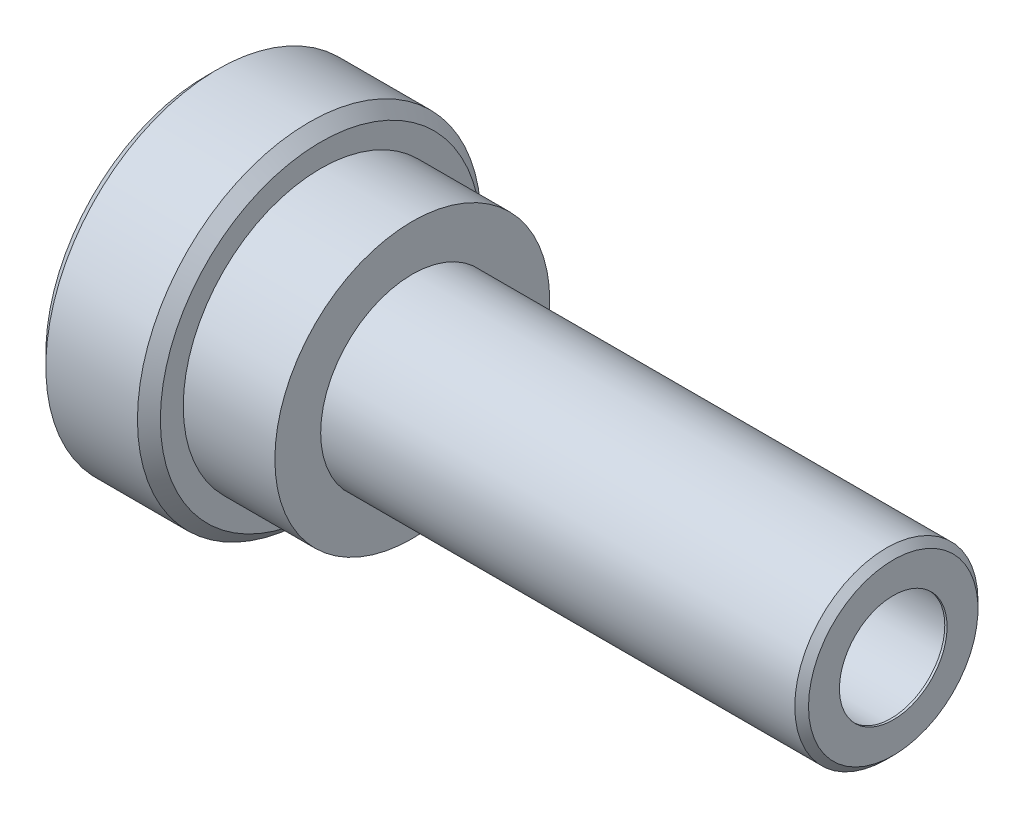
ISO-10303-21;
HEADER;
FILE_DESCRIPTION(('STEP AP214'),'2;1');
FILE_NAME('part.step','',(''),(''),'','','');
FILE_SCHEMA(('AUTOMOTIVE_DESIGN { 1 0 10303 214 1 1 1 1 }'));
ENDSEC;
DATA;
#1=APPLICATION_CONTEXT('core data for automotive mechanical design processes');
#2=APPLICATION_PROTOCOL_DEFINITION('international standard','automotive_design',2000,#1);
#3=PRODUCT_CONTEXT('',#1,'mechanical');
#4=PRODUCT('Part','Part','',(#3));
#5=PRODUCT_RELATED_PRODUCT_CATEGORY('part','',(#4));
#6=PRODUCT_DEFINITION_FORMATION('','',#4);
#7=PRODUCT_DEFINITION_CONTEXT('part definition',#1,'design');
#8=PRODUCT_DEFINITION('design','',#6,#7);
#9=PRODUCT_DEFINITION_SHAPE('','',#8);
#10=(LENGTH_UNIT() NAMED_UNIT(*) SI_UNIT(.MILLI.,.METRE.));
#11=(NAMED_UNIT(*) PLANE_ANGLE_UNIT() SI_UNIT($,.RADIAN.));
#12=(NAMED_UNIT(*) SI_UNIT($,.STERADIAN.) SOLID_ANGLE_UNIT());
#13=UNCERTAINTY_MEASURE_WITH_UNIT(LENGTH_MEASURE(1.E-05),#10,'distance_accuracy_value','');
#14=(GEOMETRIC_REPRESENTATION_CONTEXT(3) GLOBAL_UNCERTAINTY_ASSIGNED_CONTEXT((#13)) GLOBAL_UNIT_ASSIGNED_CONTEXT((#10,
#11,#12)) REPRESENTATION_CONTEXT('',''));
#15=CARTESIAN_POINT('',(0.,0.,0.));
#16=DIRECTION('',(0.,0.,1.));
#17=DIRECTION('',(1.,0.,0.));
#18=AXIS2_PLACEMENT_3D('',#15,#16,#17);
#19=CARTESIAN_POINT('',(0.,0.,0.));
#20=DIRECTION('',(1.,0.,0.));
#21=DIRECTION('',(0.,0.,-1.));
#22=AXIS2_PLACEMENT_3D('',#19,#20,#21);
#23=PLANE('',#22);
#24=CARTESIAN_POINT('',(0.,0.,0.));
#25=DIRECTION('',(1.,0.,0.));
#26=DIRECTION('',(0.,0.,-1.));
#27=AXIS2_PLACEMENT_3D('',#24,#25,#26);
#28=CIRCLE('',#27,7.00000000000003);
#29=CARTESIAN_POINT('',(0.,0.,-7.00000000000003));
#30=VERTEX_POINT('',#29);
#31=EDGE_CURVE('E17',#30,#30,#28,.T.);
#32=ORIENTED_EDGE('',*,*,#31,.F.);
#33=EDGE_LOOP('',(#32));
#34=FACE_BOUND('',#33,.T.);
#35=CARTESIAN_POINT('',(5.6843418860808E-11,0.,0.));
#36=DIRECTION('',(-1.,0.,0.));
#37=DIRECTION('',(0.,0.,1.));
#38=AXIS2_PLACEMENT_3D('',#35,#36,#37);
#39=CIRCLE('',#38,3.24999999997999);
#40=CARTESIAN_POINT('',(5.6843418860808E-11,0.,3.24999999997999));
#41=VERTEX_POINT('',#40);
#42=EDGE_CURVE('E45',#41,#41,#39,.F.);
#43=ORIENTED_EDGE('',*,*,#42,.T.);
#44=EDGE_LOOP('',(#43));
#45=FACE_BOUND('',#44,.T.);
#46=ADVANCED_FACE('F14',(#34,#45),#23,.F.);
#47=CARTESIAN_POINT('',(0.5,0.,0.));
#48=DIRECTION('',(1.,0.,0.));
#49=DIRECTION('',(0.,0.,-1.));
#50=AXIS2_PLACEMENT_3D('',#47,#48,#49);
#51=CONICAL_SURFACE('',#50,7.49999999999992,0.7853981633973);
#52=CARTESIAN_POINT('',(0.5,0.,0.));
#53=DIRECTION('',(1.,0.,0.));
#54=DIRECTION('',(0.,0.,-1.));
#55=AXIS2_PLACEMENT_3D('',#52,#53,#54);
#56=CIRCLE('',#55,7.5);
#57=CARTESIAN_POINT('',(0.5,0.,-7.5));
#58=VERTEX_POINT('',#57);
#59=EDGE_CURVE('E43',#58,#58,#56,.T.);
#60=ORIENTED_EDGE('',*,*,#59,.F.);
#61=EDGE_LOOP('',(#60));
#62=FACE_BOUND('',#61,.T.);
#63=ORIENTED_EDGE('',*,*,#31,.T.);
#64=EDGE_LOOP('',(#63));
#65=FACE_BOUND('',#64,.T.);
#66=ADVANCED_FACE('F64',(#62,#65),#51,.T.);
#67=CARTESIAN_POINT('',(5.6843418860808E-11,0.,0.));
#68=DIRECTION('',(-1.,0.,0.));
#69=DIRECTION('',(0.,0.,1.));
#70=AXIS2_PLACEMENT_3D('',#67,#68,#69);
#71=CONICAL_SURFACE('',#70,3.24999999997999,0.785398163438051);
#72=CARTESIAN_POINT('',(0.700000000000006,0.,0.));
#73=DIRECTION('',(1.,0.,0.));
#74=DIRECTION('',(0.,0.,-1.));
#75=AXIS2_PLACEMENT_3D('',#72,#73,#74);
#76=CIRCLE('',#75,2.55);
#77=CARTESIAN_POINT('',(0.700000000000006,0.,-2.55));
#78=VERTEX_POINT('',#77);
#79=EDGE_CURVE('E40',#78,#78,#76,.T.);
#80=ORIENTED_EDGE('',*,*,#79,.T.);
#81=EDGE_LOOP('',(#80));
#82=FACE_BOUND('',#81,.T.);
#83=ORIENTED_EDGE('',*,*,#42,.F.);
#84=EDGE_LOOP('',(#83));
#85=FACE_BOUND('',#84,.T.);
#86=ADVANCED_FACE('F71',(#82,#85),#71,.F.);
#87=CARTESIAN_POINT('',(-1.5,0.,0.));
#88=DIRECTION('',(1.,0.,0.));
#89=DIRECTION('',(0.,0.,-1.));
#90=AXIS2_PLACEMENT_3D('',#87,#88,#89);
#91=CYLINDRICAL_SURFACE('',#90,7.5);
#92=CARTESIAN_POINT('',(4.49999999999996,0.,0.));
#93=DIRECTION('',(-1.,0.,0.));
#94=DIRECTION('',(0.,0.,1.));
#95=AXIS2_PLACEMENT_3D('',#92,#93,#94);
#96=CIRCLE('',#95,7.49999999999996);
#97=CARTESIAN_POINT('',(4.49999999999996,0.,7.49999999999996));
#98=VERTEX_POINT('',#97);
#99=EDGE_CURVE('E37',#98,#98,#96,.F.);
#100=ORIENTED_EDGE('',*,*,#99,.F.);
#101=EDGE_LOOP('',(#100));
#102=FACE_BOUND('',#101,.T.);
#103=ORIENTED_EDGE('',*,*,#59,.T.);
#104=EDGE_LOOP('',(#103));
#105=FACE_BOUND('',#104,.T.);
#106=ADVANCED_FACE('F115',(#102,#105),#91,.T.);
#107=CARTESIAN_POINT('',(-1.5,0.,0.));
#108=DIRECTION('',(1.,0.,0.));
#109=DIRECTION('',(0.,0.,-1.));
#110=AXIS2_PLACEMENT_3D('',#107,#108,#109);
#111=CYLINDRICAL_SURFACE('',#110,2.55);
#112=CARTESIAN_POINT('',(29.7798278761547,0.,0.));
#113=DIRECTION('',(-1.,0.,0.));
#114=DIRECTION('',(0.,-1.,0.));
#115=AXIS2_PLACEMENT_3D('',#112,#113,#114);
#116=CIRCLE('',#115,2.55000000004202);
#117=CARTESIAN_POINT('',(29.7798278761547,-2.55000000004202,0.));
#118=VERTEX_POINT('',#117);
#119=EDGE_CURVE('E34',#118,#118,#116,.F.);
#120=ORIENTED_EDGE('',*,*,#119,.T.);
#121=EDGE_LOOP('',(#120));
#122=FACE_BOUND('',#121,.T.);
#123=ORIENTED_EDGE('',*,*,#79,.F.);
#124=EDGE_LOOP('',(#123));
#125=FACE_BOUND('',#124,.T.);
#126=ADVANCED_FACE('F111',(#122,#125),#111,.F.);
#127=CARTESIAN_POINT('',(4.49999999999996,0.,0.));
#128=DIRECTION('',(-1.,0.,0.));
#129=DIRECTION('',(0.,0.,1.));
#130=AXIS2_PLACEMENT_3D('',#127,#128,#129);
#131=CONICAL_SURFACE('',#130,7.49999999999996,0.785398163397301);
#132=ORIENTED_EDGE('',*,*,#99,.T.);
#133=EDGE_LOOP('',(#132));
#134=FACE_BOUND('',#133,.T.);
#135=CARTESIAN_POINT('',(5.00000000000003,0.,0.));
#136=DIRECTION('',(-1.,0.,0.));
#137=DIRECTION('',(0.,0.,1.));
#138=AXIS2_PLACEMENT_3D('',#135,#136,#137);
#139=CIRCLE('',#138,7.00000000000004);
#140=CARTESIAN_POINT('',(5.00000000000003,0.,7.00000000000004));
#141=VERTEX_POINT('',#140);
#142=EDGE_CURVE('E33',#141,#141,#139,.F.);
#143=ORIENTED_EDGE('',*,*,#142,.F.);
#144=EDGE_LOOP('',(#143));
#145=FACE_BOUND('',#144,.T.);
#146=ADVANCED_FACE('F107',(#134,#145),#131,.T.);
#147=CARTESIAN_POINT('',(29.7798278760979,0.,0.));
#148=DIRECTION('',(-1.,0.,0.));
#149=DIRECTION('',(0.,-1.,0.));
#150=AXIS2_PLACEMENT_3D('',#147,#148,#149);
#151=CONICAL_SURFACE('',#150,2.55000000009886,1.02974425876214);
#152=CARTESIAN_POINT('',(29.9,0.,0.));
#153=DIRECTION('',(1.,0.,0.));
#154=DIRECTION('',(0.,0.,-1.));
#155=AXIS2_PLACEMENT_3D('',#152,#153,#154);
#156=CIRCLE('',#155,2.35);
#157=CARTESIAN_POINT('',(29.9,0.,-2.35));
#158=VERTEX_POINT('',#157);
#159=EDGE_CURVE('E29',#158,#158,#156,.T.);
#160=ORIENTED_EDGE('',*,*,#159,.T.);
#161=EDGE_LOOP('',(#160));
#162=FACE_BOUND('',#161,.T.);
#163=ORIENTED_EDGE('',*,*,#119,.F.);
#164=EDGE_LOOP('',(#163));
#165=FACE_BOUND('',#164,.T.);
#166=ADVANCED_FACE('F103',(#162,#165),#151,.F.);
#167=CARTESIAN_POINT('',(5.,0.,0.));
#168=DIRECTION('',(1.,0.,0.));
#169=DIRECTION('',(0.,0.,-1.));
#170=AXIS2_PLACEMENT_3D('',#167,#168,#169);
#171=PLANE('',#170);
#172=ORIENTED_EDGE('',*,*,#142,.T.);
#173=EDGE_LOOP('',(#172));
#174=FACE_BOUND('',#173,.T.);
#175=CARTESIAN_POINT('',(5.,0.,0.));
#176=DIRECTION('',(1.,0.,0.));
#177=DIRECTION('',(0.,0.,-1.));
#178=AXIS2_PLACEMENT_3D('',#175,#176,#177);
#179=CIRCLE('',#178,6.);
#180=CARTESIAN_POINT('',(5.,0.,-6.));
#181=VERTEX_POINT('',#180);
#182=EDGE_CURVE('E32',#181,#181,#179,.T.);
#183=ORIENTED_EDGE('',*,*,#182,.F.);
#184=EDGE_LOOP('',(#183));
#185=FACE_BOUND('',#184,.T.);
#186=ADVANCED_FACE('F99',(#174,#185),#171,.T.);
#187=CARTESIAN_POINT('',(-1.5,0.,0.));
#188=DIRECTION('',(1.,0.,0.));
#189=DIRECTION('',(0.,0.,-1.));
#190=AXIS2_PLACEMENT_3D('',#187,#188,#189);
#191=CYLINDRICAL_SURFACE('',#190,2.35);
#192=ORIENTED_EDGE('',*,*,#159,.F.);
#193=EDGE_LOOP('',(#192));
#194=FACE_BOUND('',#193,.T.);
#195=CARTESIAN_POINT('',(30.,0.,0.));
#196=DIRECTION('',(1.,0.,0.));
#197=DIRECTION('',(0.,0.,-1.));
#198=AXIS2_PLACEMENT_3D('',#195,#196,#197);
#199=CIRCLE('',#198,2.35);
#200=CARTESIAN_POINT('',(30.,0.,-2.35));
#201=VERTEX_POINT('',#200);
#202=EDGE_CURVE('E52',#201,#201,#199,.F.);
#203=ORIENTED_EDGE('',*,*,#202,.F.);
#204=EDGE_LOOP('',(#203));
#205=FACE_BOUND('',#204,.T.);
#206=ADVANCED_FACE('F95',(#194,#205),#191,.F.);
#207=CARTESIAN_POINT('',(-1.5,0.,0.));
#208=DIRECTION('',(1.,0.,0.));
#209=DIRECTION('',(0.,0.,-1.));
#210=AXIS2_PLACEMENT_3D('',#207,#208,#209);
#211=CYLINDRICAL_SURFACE('',#210,6.);
#212=ORIENTED_EDGE('',*,*,#182,.T.);
#213=EDGE_LOOP('',(#212));
#214=FACE_BOUND('',#213,.T.);
#215=CARTESIAN_POINT('',(8.99999999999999,0.,0.));
#216=DIRECTION('',(1.,0.,0.));
#217=DIRECTION('',(0.,0.,-1.));
#218=AXIS2_PLACEMENT_3D('',#215,#216,#217);
#219=CIRCLE('',#218,6.);
#220=CARTESIAN_POINT('',(8.99999999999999,0.,-6.));
#221=VERTEX_POINT('',#220);
#222=EDGE_CURVE('E49',#221,#221,#219,.T.);
#223=ORIENTED_EDGE('',*,*,#222,.F.);
#224=EDGE_LOOP('',(#223));
#225=FACE_BOUND('',#224,.T.);
#226=ADVANCED_FACE('F91',(#214,#225),#211,.T.);
#227=CARTESIAN_POINT('',(30.,0.,0.));
#228=DIRECTION('',(1.,0.,0.));
#229=DIRECTION('',(0.,0.,-1.));
#230=AXIS2_PLACEMENT_3D('',#227,#228,#229);
#231=PLANE('',#230);
#232=CARTESIAN_POINT('',(29.9999999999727,0.,0.));
#233=DIRECTION('',(-1.,0.,0.));
#234=DIRECTION('',(0.,0.,1.));
#235=AXIS2_PLACEMENT_3D('',#232,#233,#234);
#236=CIRCLE('',#235,3.69999999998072);
#237=CARTESIAN_POINT('',(29.9999999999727,0.,3.69999999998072));
#238=VERTEX_POINT('',#237);
#239=EDGE_CURVE('E26',#238,#238,#236,.T.);
#240=ORIENTED_EDGE('',*,*,#239,.F.);
#241=EDGE_LOOP('',(#240));
#242=FACE_BOUND('',#241,.T.);
#243=ORIENTED_EDGE('',*,*,#202,.T.);
#244=EDGE_LOOP('',(#243));
#245=FACE_BOUND('',#244,.T.);
#246=ADVANCED_FACE('F87',(#242,#245),#231,.T.);
#247=CARTESIAN_POINT('',(8.99999999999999,0.,0.));
#248=DIRECTION('',(1.,0.,0.));
#249=DIRECTION('',(0.,0.,-1.));
#250=AXIS2_PLACEMENT_3D('',#247,#248,#249);
#251=PLANE('',#250);
#252=ORIENTED_EDGE('',*,*,#222,.T.);
#253=EDGE_LOOP('',(#252));
#254=FACE_BOUND('',#253,.T.);
#255=CARTESIAN_POINT('',(8.99999999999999,0.,0.));
#256=DIRECTION('',(1.,0.,0.));
#257=DIRECTION('',(0.,0.,-1.));
#258=AXIS2_PLACEMENT_3D('',#255,#256,#257);
#259=CIRCLE('',#258,4.);
#260=CARTESIAN_POINT('',(8.99999999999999,0.,-4.));
#261=VERTEX_POINT('',#260);
#262=EDGE_CURVE('E21',#261,#261,#259,.T.);
#263=ORIENTED_EDGE('',*,*,#262,.F.);
#264=EDGE_LOOP('',(#263));
#265=FACE_BOUND('',#264,.T.);
#266=ADVANCED_FACE('F80',(#254,#265),#251,.T.);
#267=CARTESIAN_POINT('',(29.6999999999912,0.,0.));
#268=DIRECTION('',(-1.,0.,0.));
#269=DIRECTION('',(0.,0.,1.));
#270=AXIS2_PLACEMENT_3D('',#267,#268,#269);
#271=CONICAL_SURFACE('',#270,3.99999999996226,0.785398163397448);
#272=CARTESIAN_POINT('',(29.7,0.,0.));
#273=DIRECTION('',(1.,0.,0.));
#274=DIRECTION('',(0.,0.,-1.));
#275=AXIS2_PLACEMENT_3D('',#272,#273,#274);
#276=CIRCLE('',#275,4.);
#277=CARTESIAN_POINT('',(29.7,0.,-4.));
#278=VERTEX_POINT('',#277);
#279=EDGE_CURVE('E10',#278,#278,#276,.F.);
#280=ORIENTED_EDGE('',*,*,#279,.F.);
#281=EDGE_LOOP('',(#280));
#282=FACE_BOUND('',#281,.T.);
#283=ORIENTED_EDGE('',*,*,#239,.T.);
#284=EDGE_LOOP('',(#283));
#285=FACE_BOUND('',#284,.T.);
#286=ADVANCED_FACE('F75',(#282,#285),#271,.T.);
#287=CARTESIAN_POINT('',(-1.5,0.,0.));
#288=DIRECTION('',(1.,0.,0.));
#289=DIRECTION('',(0.,0.,-1.));
#290=AXIS2_PLACEMENT_3D('',#287,#288,#289);
#291=CYLINDRICAL_SURFACE('',#290,4.);
#292=ORIENTED_EDGE('',*,*,#279,.T.);
#293=EDGE_LOOP('',(#292));
#294=FACE_BOUND('',#293,.T.);
#295=ORIENTED_EDGE('',*,*,#262,.T.);
#296=EDGE_LOOP('',(#295));
#297=FACE_BOUND('',#296,.T.);
#298=ADVANCED_FACE('F73',(#294,#297),#291,.T.);
#299=CLOSED_SHELL('',(#46,#66,#86,#106,#126,#146,#166,#186,#206,#226,#246,#266,#286,#298));
#300=MANIFOLD_SOLID_BREP('B1',#299);
#301=ADVANCED_BREP_SHAPE_REPRESENTATION('',(#18,#300),#14);
#302=SHAPE_DEFINITION_REPRESENTATION(#9,#301);
ENDSEC;
END-ISO-10303-21;
